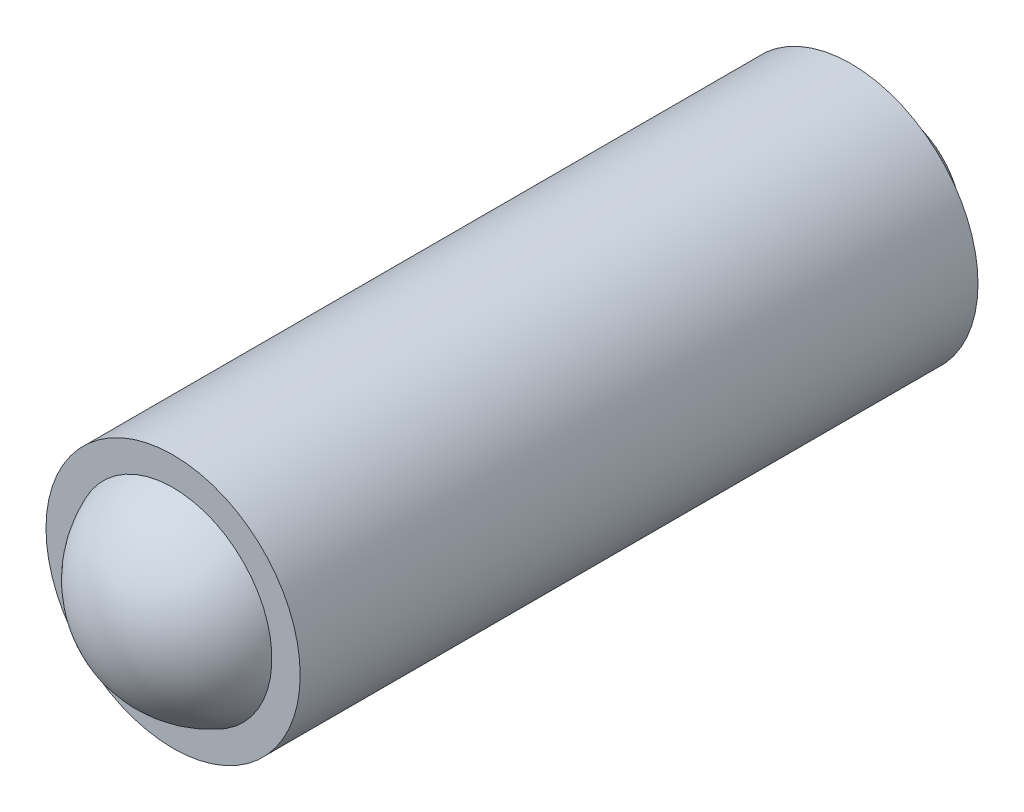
ISO-10303-21;
HEADER;
FILE_DESCRIPTION(('STEP AP214'),'2;1');
FILE_NAME('part.step','',(''),(''),'','','');
FILE_SCHEMA(('AUTOMOTIVE_DESIGN { 1 0 10303 214 1 1 1 1 }'));
ENDSEC;
DATA;
#1=APPLICATION_CONTEXT('core data for automotive mechanical design processes');
#2=APPLICATION_PROTOCOL_DEFINITION('international standard','automotive_design',2000,#1);
#3=PRODUCT_CONTEXT('',#1,'mechanical');
#4=PRODUCT('Part','Part','',(#3));
#5=PRODUCT_RELATED_PRODUCT_CATEGORY('part','',(#4));
#6=PRODUCT_DEFINITION_FORMATION('','',#4);
#7=PRODUCT_DEFINITION_CONTEXT('part definition',#1,'design');
#8=PRODUCT_DEFINITION('design','',#6,#7);
#9=PRODUCT_DEFINITION_SHAPE('','',#8);
#10=(LENGTH_UNIT() NAMED_UNIT(*) SI_UNIT(.MILLI.,.METRE.));
#11=(NAMED_UNIT(*) PLANE_ANGLE_UNIT() SI_UNIT($,.RADIAN.));
#12=(NAMED_UNIT(*) SI_UNIT($,.STERADIAN.) SOLID_ANGLE_UNIT());
#13=UNCERTAINTY_MEASURE_WITH_UNIT(LENGTH_MEASURE(1.E-05),#10,'distance_accuracy_value','');
#14=(GEOMETRIC_REPRESENTATION_CONTEXT(3) GLOBAL_UNCERTAINTY_ASSIGNED_CONTEXT((#13)) GLOBAL_UNIT_ASSIGNED_CONTEXT((#10,
#11,#12)) REPRESENTATION_CONTEXT('',''));
#15=CARTESIAN_POINT('',(0.,0.,0.));
#16=DIRECTION('',(0.,0.,1.));
#17=DIRECTION('',(1.,0.,0.));
#18=AXIS2_PLACEMENT_3D('',#15,#16,#17);
#19=CARTESIAN_POINT('',(0.,0.,-10.2781709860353));
#20=DIRECTION('',(0.,0.,-1.));
#21=DIRECTION('',(-1.,0.,0.));
#22=AXIS2_PLACEMENT_3D('',#19,#20,#21);
#23=CYLINDRICAL_SURFACE('',#22,1.5);
#24=CARTESIAN_POINT('',(0.,0.,4.));
#25=DIRECTION('',(0.,0.,-1.));
#26=DIRECTION('',(-1.,0.,0.));
#27=AXIS2_PLACEMENT_3D('',#24,#25,#26);
#28=CIRCLE('',#27,1.5);
#29=CARTESIAN_POINT('',(-1.5,0.,4.));
#30=VERTEX_POINT('',#29);
#31=EDGE_CURVE('E8',#30,#30,#28,.T.);
#32=ORIENTED_EDGE('',*,*,#31,.T.);
#33=EDGE_LOOP('',(#32));
#34=FACE_BOUND('',#33,.T.);
#35=CARTESIAN_POINT('',(0.,0.,-4.));
#36=DIRECTION('',(0.,0.,-1.));
#37=DIRECTION('',(-1.,0.,0.));
#38=AXIS2_PLACEMENT_3D('',#35,#36,#37);
#39=CIRCLE('',#38,1.5);
#40=CARTESIAN_POINT('',(-1.5,0.,-4.));
#41=VERTEX_POINT('',#40);
#42=EDGE_CURVE('E26',#41,#41,#39,.T.);
#43=ORIENTED_EDGE('',*,*,#42,.F.);
#44=EDGE_LOOP('',(#43));
#45=FACE_BOUND('',#44,.T.);
#46=ADVANCED_FACE('F12',(#34,#45),#23,.T.);
#47=CARTESIAN_POINT('',(-1.16619037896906,0.,4.));
#48=DIRECTION('',(0.,0.,1.));
#49=DIRECTION('',(1.,0.,0.));
#50=AXIS2_PLACEMENT_3D('',#47,#48,#49);
#51=PLANE('',#50);
#52=CARTESIAN_POINT('',(0.,0.,4.));
#53=DIRECTION('',(0.,0.,-1.));
#54=DIRECTION('',(-1.,0.,0.));
#55=AXIS2_PLACEMENT_3D('',#52,#53,#54);
#56=CIRCLE('',#55,1.16619037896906);
#57=CARTESIAN_POINT('',(-1.16619037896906,0.,4.));
#58=VERTEX_POINT('',#57);
#59=EDGE_CURVE('E18',#58,#58,#56,.T.);
#60=ORIENTED_EDGE('',*,*,#59,.T.);
#61=EDGE_LOOP('',(#60));
#62=FACE_BOUND('',#61,.T.);
#63=ORIENTED_EDGE('',*,*,#31,.F.);
#64=EDGE_LOOP('',(#63));
#65=FACE_BOUND('',#64,.T.);
#66=ADVANCED_FACE('F36',(#62,#65),#51,.T.);
#67=CARTESIAN_POINT('',(0.,0.,3.55));
#68=DIRECTION('',(0.,0.,-1.));
#69=DIRECTION('',(-1.,0.,0.));
#70=AXIS2_PLACEMENT_3D('',#67,#68,#69);
#71=SPHERICAL_SURFACE('',#70,1.25);
#72=ORIENTED_EDGE('',*,*,#59,.F.);
#73=EDGE_LOOP('',(#72));
#74=FACE_BOUND('',#73,.T.);
#75=ADVANCED_FACE('F42',(#74),#71,.T.);
#76=CARTESIAN_POINT('',(0.,0.,-3.55));
#77=DIRECTION('',(0.,0.,-1.));
#78=DIRECTION('',(-1.,0.,0.));
#79=AXIS2_PLACEMENT_3D('',#76,#77,#78);
#80=SPHERICAL_SURFACE('',#79,1.25);
#81=CARTESIAN_POINT('',(0.,0.,-4.));
#82=DIRECTION('',(0.,0.,-1.));
#83=DIRECTION('',(-1.,0.,0.));
#84=AXIS2_PLACEMENT_3D('',#81,#82,#83);
#85=CIRCLE('',#84,1.16619037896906);
#86=CARTESIAN_POINT('',(-1.16619037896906,0.,-4.));
#87=VERTEX_POINT('',#86);
#88=EDGE_CURVE('E22',#87,#87,#85,.T.);
#89=ORIENTED_EDGE('',*,*,#88,.T.);
#90=EDGE_LOOP('',(#89));
#91=FACE_BOUND('',#90,.T.);
#92=ADVANCED_FACE('F47',(#91),#80,.T.);
#93=CARTESIAN_POINT('',(-1.16619037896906,0.,-4.));
#94=DIRECTION('',(0.,0.,-1.));
#95=DIRECTION('',(-1.,0.,0.));
#96=AXIS2_PLACEMENT_3D('',#93,#94,#95);
#97=PLANE('',#96);
#98=ORIENTED_EDGE('',*,*,#42,.T.);
#99=EDGE_LOOP('',(#98));
#100=FACE_BOUND('',#99,.T.);
#101=ORIENTED_EDGE('',*,*,#88,.F.);
#102=EDGE_LOOP('',(#101));
#103=FACE_BOUND('',#102,.T.);
#104=ADVANCED_FACE('F32',(#100,#103),#97,.T.);
#105=CLOSED_SHELL('',(#46,#66,#75,#92,#104));
#106=MANIFOLD_SOLID_BREP('B1',#105);
#107=ADVANCED_BREP_SHAPE_REPRESENTATION('',(#18,#106),#14);
#108=SHAPE_DEFINITION_REPRESENTATION(#9,#107);
ENDSEC;
END-ISO-10303-21;
